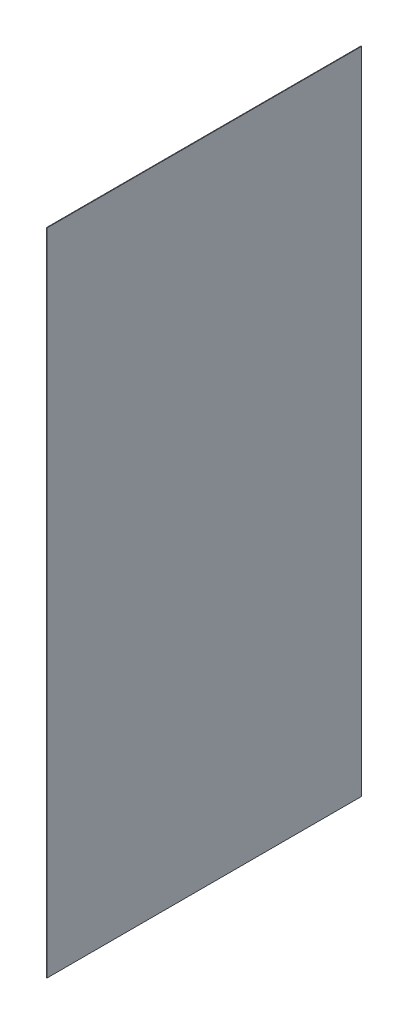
from build123d import *

# Parameters (mm, degrees)
SKETCH1_W           = 1720.85
SKETCH1_H           = 3556
BOSS_EXTRUDE1_DEPTH = 3.175


with BuildPart() as part:
    # Sketch1 → Boss-Extrude1 (new body)
    with BuildSketch(Plane(origin=(3.175, 0, 0), x_dir=(0, 0, -1), z_dir=(1, 0, 0))):
        with Locations((827.562862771, 1726.139439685)):
            Rectangle(SKETCH1_W, SKETCH1_H)
    extrude(amount=-BOSS_EXTRUDE1_DEPTH)


solid = part.part
